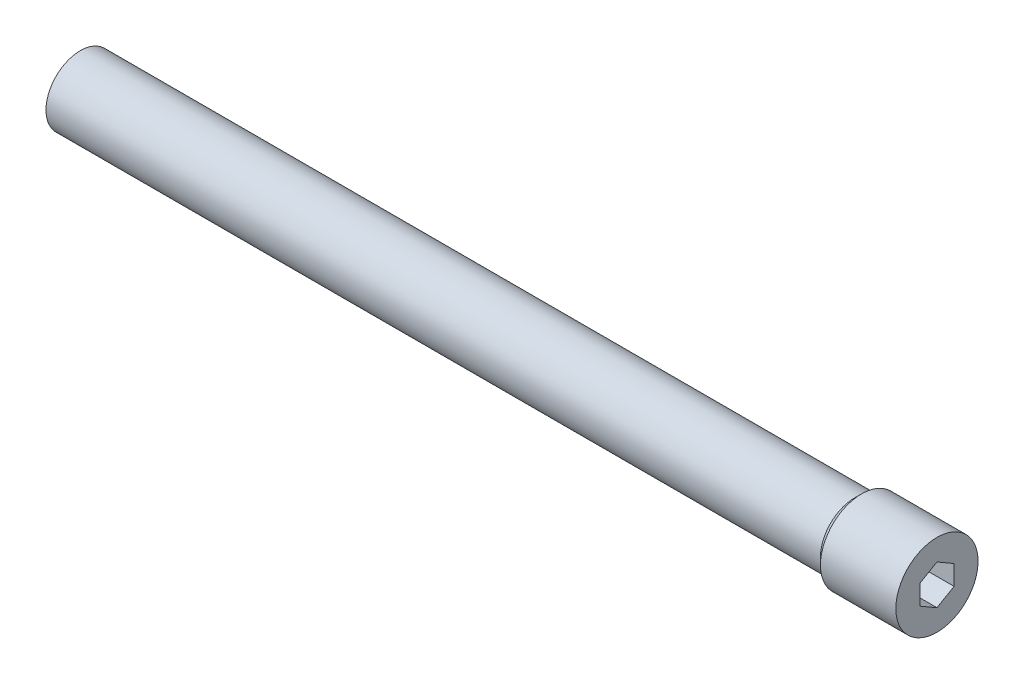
ISO-10303-21;
HEADER;
FILE_DESCRIPTION(('STEP AP214'),'2;1');
FILE_NAME('part.step','',(''),(''),'','','');
FILE_SCHEMA(('AUTOMOTIVE_DESIGN { 1 0 10303 214 1 1 1 1 }'));
ENDSEC;
DATA;
#1=APPLICATION_CONTEXT('core data for automotive mechanical design processes');
#2=APPLICATION_PROTOCOL_DEFINITION('international standard','automotive_design',2000,#1);
#3=PRODUCT_CONTEXT('',#1,'mechanical');
#4=PRODUCT('Part','Part','',(#3));
#5=PRODUCT_RELATED_PRODUCT_CATEGORY('part','',(#4));
#6=PRODUCT_DEFINITION_FORMATION('','',#4);
#7=PRODUCT_DEFINITION_CONTEXT('part definition',#1,'design');
#8=PRODUCT_DEFINITION('design','',#6,#7);
#9=PRODUCT_DEFINITION_SHAPE('','',#8);
#10=(LENGTH_UNIT() NAMED_UNIT(*) SI_UNIT(.MILLI.,.METRE.));
#11=(NAMED_UNIT(*) PLANE_ANGLE_UNIT() SI_UNIT($,.RADIAN.));
#12=(NAMED_UNIT(*) SI_UNIT($,.STERADIAN.) SOLID_ANGLE_UNIT());
#13=UNCERTAINTY_MEASURE_WITH_UNIT(LENGTH_MEASURE(1.E-05),#10,'distance_accuracy_value','');
#14=(GEOMETRIC_REPRESENTATION_CONTEXT(3) GLOBAL_UNCERTAINTY_ASSIGNED_CONTEXT((#13)) GLOBAL_UNIT_ASSIGNED_CONTEXT((#10,
#11,#12)) REPRESENTATION_CONTEXT('',''));
#15=CARTESIAN_POINT('',(0.,0.,0.));
#16=DIRECTION('',(0.,0.,1.));
#17=DIRECTION('',(1.,0.,0.));
#18=AXIS2_PLACEMENT_3D('',#15,#16,#17);
#19=CARTESIAN_POINT('',(0.,0.,0.));
#20=DIRECTION('',(1.,0.,0.));
#21=DIRECTION('',(0.,0.,-1.));
#22=AXIS2_PLACEMENT_3D('',#19,#20,#21);
#23=PLANE('',#22);
#24=CARTESIAN_POINT('',(0.,0.,0.));
#25=DIRECTION('',(-1.,0.,0.));
#26=DIRECTION('',(0.,0.,1.));
#27=AXIS2_PLACEMENT_3D('',#24,#25,#26);
#28=CIRCLE('',#27,5.);
#29=CARTESIAN_POINT('',(0.,0.,5.));
#30=VERTEX_POINT('',#29);
#31=EDGE_CURVE('E10',#30,#30,#28,.T.);
#32=ORIENTED_EDGE('',*,*,#31,.T.);
#33=EDGE_LOOP('',(#32));
#34=FACE_BOUND('',#33,.T.);
#35=ADVANCED_FACE('F16',(#34),#23,.F.);
#36=CARTESIAN_POINT('',(0.,0.,0.));
#37=DIRECTION('',(-1.,0.,0.));
#38=DIRECTION('',(0.,0.,1.));
#39=AXIS2_PLACEMENT_3D('',#36,#37,#38);
#40=CYLINDRICAL_SURFACE('',#39,5.);
#41=ORIENTED_EDGE('',*,*,#31,.F.);
#42=EDGE_LOOP('',(#41));
#43=FACE_BOUND('',#42,.T.);
#44=CARTESIAN_POINT('',(113.,0.,0.));
#45=DIRECTION('',(-1.,0.,0.));
#46=DIRECTION('',(0.,0.,1.));
#47=AXIS2_PLACEMENT_3D('',#44,#45,#46);
#48=CIRCLE('',#47,5.);
#49=CARTESIAN_POINT('',(113.,0.,5.));
#50=VERTEX_POINT('',#49);
#51=EDGE_CURVE('E23',#50,#50,#48,.T.);
#52=ORIENTED_EDGE('',*,*,#51,.T.);
#53=EDGE_LOOP('',(#52));
#54=FACE_BOUND('',#53,.T.);
#55=ADVANCED_FACE('F130',(#43,#54),#40,.T.);
#56=CARTESIAN_POINT('',(114.,0.,0.));
#57=DIRECTION('',(1.,0.,0.));
#58=DIRECTION('',(0.,0.,-1.));
#59=AXIS2_PLACEMENT_3D('',#56,#57,#58);
#60=CONICAL_SURFACE('',#59,6.,0.78539816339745);
#61=ORIENTED_EDGE('',*,*,#51,.F.);
#62=EDGE_LOOP('',(#61));
#63=FACE_BOUND('',#62,.T.);
#64=CARTESIAN_POINT('',(114.,0.,0.));
#65=DIRECTION('',(-1.,0.,0.));
#66=DIRECTION('',(0.,0.,1.));
#67=AXIS2_PLACEMENT_3D('',#64,#65,#66);
#68=CIRCLE('',#67,6.);
#69=CARTESIAN_POINT('',(114.,0.,6.));
#70=VERTEX_POINT('',#69);
#71=EDGE_CURVE('E125',#70,#70,#68,.T.);
#72=ORIENTED_EDGE('',*,*,#71,.T.);
#73=EDGE_LOOP('',(#72));
#74=FACE_BOUND('',#73,.T.);
#75=ADVANCED_FACE('F132',(#63,#74),#60,.T.);
#76=CARTESIAN_POINT('',(0.,0.,0.));
#77=DIRECTION('',(-1.,0.,0.));
#78=DIRECTION('',(0.,0.,1.));
#79=AXIS2_PLACEMENT_3D('',#76,#77,#78);
#80=CYLINDRICAL_SURFACE('',#79,6.);
#81=ORIENTED_EDGE('',*,*,#71,.F.);
#82=EDGE_LOOP('',(#81));
#83=FACE_BOUND('',#82,.T.);
#84=CARTESIAN_POINT('',(125.,0.,0.));
#85=DIRECTION('',(-1.,0.,0.));
#86=DIRECTION('',(0.,0.,1.));
#87=AXIS2_PLACEMENT_3D('',#84,#85,#86);
#88=CIRCLE('',#87,6.);
#89=CARTESIAN_POINT('',(125.,0.,6.));
#90=VERTEX_POINT('',#89);
#91=EDGE_CURVE('E117',#90,#90,#88,.T.);
#92=ORIENTED_EDGE('',*,*,#91,.T.);
#93=EDGE_LOOP('',(#92));
#94=FACE_BOUND('',#93,.T.);
#95=ADVANCED_FACE('F135',(#83,#94),#80,.T.);
#96=CARTESIAN_POINT('',(125.,6.,0.));
#97=DIRECTION('',(-1.,0.,0.));
#98=DIRECTION('',(0.,0.,1.));
#99=AXIS2_PLACEMENT_3D('',#96,#97,#98);
#100=PLANE('',#99);
#101=DIRECTION('',(0.,-0.5,0.866025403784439));
#102=VECTOR('',#101,1.);
#103=CARTESIAN_POINT('',(125.,2.88675134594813,0.));
#104=LINE('',#103,#102);
#105=CARTESIAN_POINT('',(125.,2.88675134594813,0.));
#106=VERTEX_POINT('',#105);
#107=CARTESIAN_POINT('',(125.,1.44337567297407,2.5));
#108=VERTEX_POINT('',#107);
#109=EDGE_CURVE('E104',#106,#108,#104,.T.);
#110=ORIENTED_EDGE('',*,*,#109,.F.);
#111=DIRECTION('',(0.,0.5,0.866025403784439));
#112=VECTOR('',#111,1.);
#113=CARTESIAN_POINT('',(125.,1.44337567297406,-2.5));
#114=LINE('',#113,#112);
#115=CARTESIAN_POINT('',(125.,1.44337567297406,-2.5));
#116=VERTEX_POINT('',#115);
#117=EDGE_CURVE('E30',#116,#106,#114,.T.);
#118=ORIENTED_EDGE('',*,*,#117,.F.);
#119=DIRECTION('',(0.,1.,0.));
#120=VECTOR('',#119,1.);
#121=CARTESIAN_POINT('',(125.,-1.44337567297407,-2.5));
#122=LINE('',#121,#120);
#123=CARTESIAN_POINT('',(125.,-1.44337567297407,-2.5));
#124=VERTEX_POINT('',#123);
#125=EDGE_CURVE('E113',#124,#116,#122,.T.);
#126=ORIENTED_EDGE('',*,*,#125,.F.);
#127=DIRECTION('',(0.,0.5,-0.866025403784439));
#128=VECTOR('',#127,1.);
#129=CARTESIAN_POINT('',(125.,-2.88675134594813,0.));
#130=LINE('',#129,#128);
#131=CARTESIAN_POINT('',(125.,-2.88675134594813,0.));
#132=VERTEX_POINT('',#131);
#133=EDGE_CURVE('E111',#132,#124,#130,.T.);
#134=ORIENTED_EDGE('',*,*,#133,.F.);
#135=DIRECTION('',(0.,-0.5,-0.866025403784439));
#136=VECTOR('',#135,1.);
#137=CARTESIAN_POINT('',(125.,-1.44337567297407,2.5));
#138=LINE('',#137,#136);
#139=CARTESIAN_POINT('',(125.,-1.44337567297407,2.5));
#140=VERTEX_POINT('',#139);
#141=EDGE_CURVE('E78',#140,#132,#138,.T.);
#142=ORIENTED_EDGE('',*,*,#141,.F.);
#143=DIRECTION('',(0.,-1.,0.));
#144=VECTOR('',#143,1.);
#145=CARTESIAN_POINT('',(125.,1.44337567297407,2.5));
#146=LINE('',#145,#144);
#147=EDGE_CURVE('E107',#108,#140,#146,.T.);
#148=ORIENTED_EDGE('',*,*,#147,.F.);
#149=EDGE_LOOP('',(#110,#118,#126,#134,#142,#148));
#150=FACE_BOUND('',#149,.T.);
#151=ORIENTED_EDGE('',*,*,#91,.F.);
#152=EDGE_LOOP('',(#151));
#153=FACE_BOUND('',#152,.T.);
#154=ADVANCED_FACE('F141',(#150,#153),#100,.F.);
#155=CARTESIAN_POINT('',(115.,1.44337567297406,-2.5));
#156=DIRECTION('',(0.,0.866025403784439,-0.5));
#157=DIRECTION('',(0.,0.5,0.866025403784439));
#158=AXIS2_PLACEMENT_3D('',#155,#156,#157);
#159=PLANE('',#158);
#160=ORIENTED_EDGE('',*,*,#117,.T.);
#161=DIRECTION('',(1.,0.,0.));
#162=VECTOR('',#161,1.);
#163=CARTESIAN_POINT('',(115.,2.88675134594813,0.));
#164=LINE('',#163,#162);
#165=CARTESIAN_POINT('',(115.,2.88675134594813,0.));
#166=VERTEX_POINT('',#165);
#167=EDGE_CURVE('E60',#166,#106,#164,.T.);
#168=ORIENTED_EDGE('',*,*,#167,.F.);
#169=DIRECTION('',(0.,0.5,0.866025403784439));
#170=VECTOR('',#169,1.);
#171=CARTESIAN_POINT('',(115.,1.44337567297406,-2.5));
#172=LINE('',#171,#170);
#173=CARTESIAN_POINT('',(115.,1.44337567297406,-2.5));
#174=VERTEX_POINT('',#173);
#175=EDGE_CURVE('E115',#174,#166,#172,.T.);
#176=ORIENTED_EDGE('',*,*,#175,.F.);
#177=DIRECTION('',(1.,0.,0.));
#178=VECTOR('',#177,1.);
#179=CARTESIAN_POINT('',(115.,1.44337567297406,-2.5));
#180=LINE('',#179,#178);
#181=EDGE_CURVE('E38',#174,#116,#180,.T.);
#182=ORIENTED_EDGE('',*,*,#181,.T.);
#183=EDGE_LOOP('',(#160,#168,#176,#182));
#184=FACE_BOUND('',#183,.T.);
#185=ADVANCED_FACE('F146',(#184),#159,.F.);
#186=CARTESIAN_POINT('',(115.,-1.44337567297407,-2.5));
#187=DIRECTION('',(0.,0.,-1.));
#188=DIRECTION('',(0.,1.,0.));
#189=AXIS2_PLACEMENT_3D('',#186,#187,#188);
#190=PLANE('',#189);
#191=ORIENTED_EDGE('',*,*,#125,.T.);
#192=ORIENTED_EDGE('',*,*,#181,.F.);
#193=DIRECTION('',(0.,1.,0.));
#194=VECTOR('',#193,1.);
#195=CARTESIAN_POINT('',(115.,-1.44337567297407,-2.5));
#196=LINE('',#195,#194);
#197=CARTESIAN_POINT('',(115.,-1.44337567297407,-2.5));
#198=VERTEX_POINT('',#197);
#199=EDGE_CURVE('E90',#198,#174,#196,.T.);
#200=ORIENTED_EDGE('',*,*,#199,.F.);
#201=DIRECTION('',(1.,0.,0.));
#202=VECTOR('',#201,1.);
#203=CARTESIAN_POINT('',(115.,-1.44337567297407,-2.5));
#204=LINE('',#203,#202);
#205=EDGE_CURVE('E82',#198,#124,#204,.T.);
#206=ORIENTED_EDGE('',*,*,#205,.T.);
#207=EDGE_LOOP('',(#191,#192,#200,#206));
#208=FACE_BOUND('',#207,.T.);
#209=ADVANCED_FACE('F154',(#208),#190,.F.);
#210=CARTESIAN_POINT('',(115.,-2.88675134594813,0.));
#211=DIRECTION('',(0.,-0.866025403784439,-0.5));
#212=DIRECTION('',(0.,0.5,-0.866025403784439));
#213=AXIS2_PLACEMENT_3D('',#210,#211,#212);
#214=PLANE('',#213);
#215=ORIENTED_EDGE('',*,*,#133,.T.);
#216=ORIENTED_EDGE('',*,*,#205,.F.);
#217=DIRECTION('',(0.,0.5,-0.866025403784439));
#218=VECTOR('',#217,1.);
#219=CARTESIAN_POINT('',(115.,-2.88675134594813,0.));
#220=LINE('',#219,#218);
#221=CARTESIAN_POINT('',(115.,-2.88675134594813,0.));
#222=VERTEX_POINT('',#221);
#223=EDGE_CURVE('E86',#222,#198,#220,.T.);
#224=ORIENTED_EDGE('',*,*,#223,.F.);
#225=DIRECTION('',(1.,0.,0.));
#226=VECTOR('',#225,1.);
#227=CARTESIAN_POINT('',(115.,-2.88675134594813,0.));
#228=LINE('',#227,#226);
#229=EDGE_CURVE('E71',#222,#132,#228,.T.);
#230=ORIENTED_EDGE('',*,*,#229,.T.);
#231=EDGE_LOOP('',(#215,#216,#224,#230));
#232=FACE_BOUND('',#231,.T.);
#233=ADVANCED_FACE('F87',(#232),#214,.F.);
#234=CARTESIAN_POINT('',(115.,-1.44337567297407,2.5));
#235=DIRECTION('',(0.,-0.866025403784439,0.5));
#236=DIRECTION('',(0.,-0.5,-0.866025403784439));
#237=AXIS2_PLACEMENT_3D('',#234,#235,#236);
#238=PLANE('',#237);
#239=ORIENTED_EDGE('',*,*,#141,.T.);
#240=ORIENTED_EDGE('',*,*,#229,.F.);
#241=DIRECTION('',(0.,-0.5,-0.866025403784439));
#242=VECTOR('',#241,1.);
#243=CARTESIAN_POINT('',(115.,-1.44337567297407,2.5));
#244=LINE('',#243,#242);
#245=CARTESIAN_POINT('',(115.,-1.44337567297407,2.5));
#246=VERTEX_POINT('',#245);
#247=EDGE_CURVE('E75',#246,#222,#244,.T.);
#248=ORIENTED_EDGE('',*,*,#247,.F.);
#249=DIRECTION('',(1.,0.,0.));
#250=VECTOR('',#249,1.);
#251=CARTESIAN_POINT('',(115.,-1.44337567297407,2.5));
#252=LINE('',#251,#250);
#253=EDGE_CURVE('E83',#246,#140,#252,.T.);
#254=ORIENTED_EDGE('',*,*,#253,.T.);
#255=EDGE_LOOP('',(#239,#240,#248,#254));
#256=FACE_BOUND('',#255,.T.);
#257=ADVANCED_FACE('F73',(#256),#238,.F.);
#258=CARTESIAN_POINT('',(115.,1.44337567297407,2.5));
#259=DIRECTION('',(0.,0.,1.));
#260=DIRECTION('',(0.,-1.,0.));
#261=AXIS2_PLACEMENT_3D('',#258,#259,#260);
#262=PLANE('',#261);
#263=ORIENTED_EDGE('',*,*,#147,.T.);
#264=ORIENTED_EDGE('',*,*,#253,.F.);
#265=DIRECTION('',(0.,-1.,0.));
#266=VECTOR('',#265,1.);
#267=CARTESIAN_POINT('',(115.,1.44337567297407,2.5));
#268=LINE('',#267,#266);
#269=CARTESIAN_POINT('',(115.,1.44337567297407,2.5));
#270=VERTEX_POINT('',#269);
#271=EDGE_CURVE('E96',#270,#246,#268,.T.);
#272=ORIENTED_EDGE('',*,*,#271,.F.);
#273=DIRECTION('',(1.,0.,0.));
#274=VECTOR('',#273,1.);
#275=CARTESIAN_POINT('',(115.,1.44337567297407,2.5));
#276=LINE('',#275,#274);
#277=EDGE_CURVE('E120',#270,#108,#276,.T.);
#278=ORIENTED_EDGE('',*,*,#277,.T.);
#279=EDGE_LOOP('',(#263,#264,#272,#278));
#280=FACE_BOUND('',#279,.T.);
#281=ADVANCED_FACE('F221',(#280),#262,.F.);
#282=CARTESIAN_POINT('',(115.,2.88675134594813,0.));
#283=DIRECTION('',(0.,0.866025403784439,0.5));
#284=DIRECTION('',(0.,-0.5,0.866025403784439));
#285=AXIS2_PLACEMENT_3D('',#282,#283,#284);
#286=PLANE('',#285);
#287=ORIENTED_EDGE('',*,*,#109,.T.);
#288=ORIENTED_EDGE('',*,*,#277,.F.);
#289=DIRECTION('',(0.,-0.5,0.866025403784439));
#290=VECTOR('',#289,1.);
#291=CARTESIAN_POINT('',(115.,2.88675134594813,0.));
#292=LINE('',#291,#290);
#293=EDGE_CURVE('E98',#166,#270,#292,.T.);
#294=ORIENTED_EDGE('',*,*,#293,.F.);
#295=ORIENTED_EDGE('',*,*,#167,.T.);
#296=EDGE_LOOP('',(#287,#288,#294,#295));
#297=FACE_BOUND('',#296,.T.);
#298=ADVANCED_FACE('F229',(#297),#286,.F.);
#299=CARTESIAN_POINT('',(115.,0.,0.));
#300=DIRECTION('',(1.,0.,0.));
#301=DIRECTION('',(0.,0.,-1.));
#302=AXIS2_PLACEMENT_3D('',#299,#300,#301);
#303=PLANE('',#302);
#304=ORIENTED_EDGE('',*,*,#175,.T.);
#305=ORIENTED_EDGE('',*,*,#293,.T.);
#306=ORIENTED_EDGE('',*,*,#271,.T.);
#307=ORIENTED_EDGE('',*,*,#247,.T.);
#308=ORIENTED_EDGE('',*,*,#223,.T.);
#309=ORIENTED_EDGE('',*,*,#199,.T.);
#310=EDGE_LOOP('',(#304,#305,#306,#307,#308,#309));
#311=FACE_BOUND('',#310,.T.);
#312=ADVANCED_FACE('F93',(#311),#303,.T.);
#313=CLOSED_SHELL('',(#35,#55,#75,#95,#154,#185,#209,#233,#257,#281,#298,#312));
#314=MANIFOLD_SOLID_BREP('B1',#313);
#315=ADVANCED_BREP_SHAPE_REPRESENTATION('',(#18,#314),#14);
#316=SHAPE_DEFINITION_REPRESENTATION(#9,#315);
ENDSEC;
END-ISO-10303-21;
